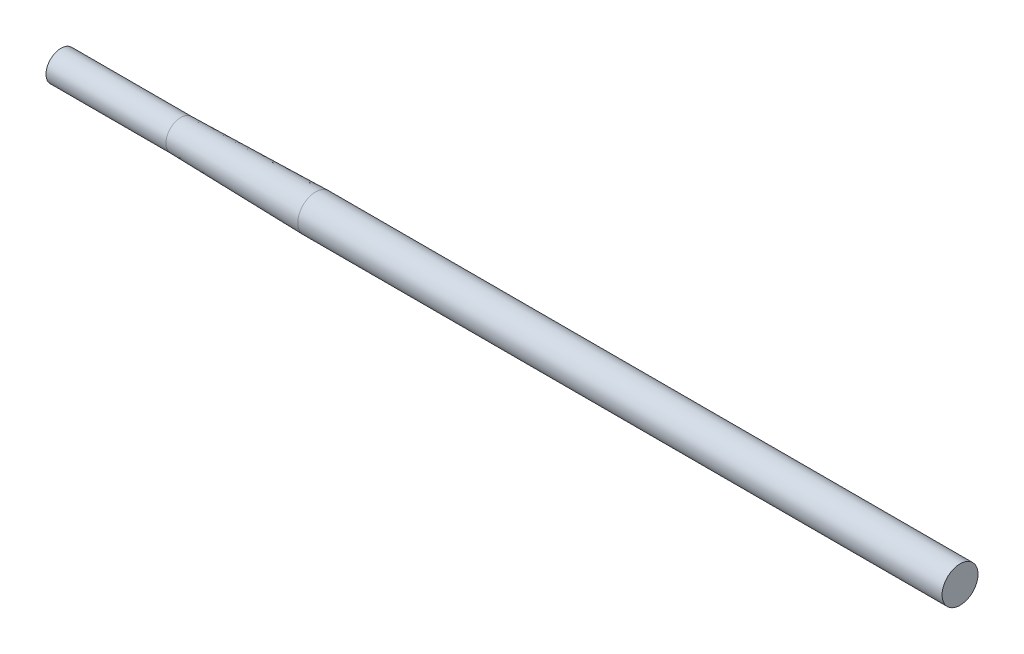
from build123d import *


with BuildPart() as part:
    # Sketch1 → Revolve1 (revolve)
    with BuildSketch(Plane.XY, mode=Mode.PRIVATE) as revolve1_sk:
        Polygon((300, 0), (300, 6), (85, 6), (40, 5), (0, 5), (0, 0), align=None)
    revolve(revolve1_sk.sketch.rotate(Axis((0, 0, 0), (1, 0, 0)), 90), axis=Axis((0, 0, 0), (1, 0, 0)))


solid = part.part
